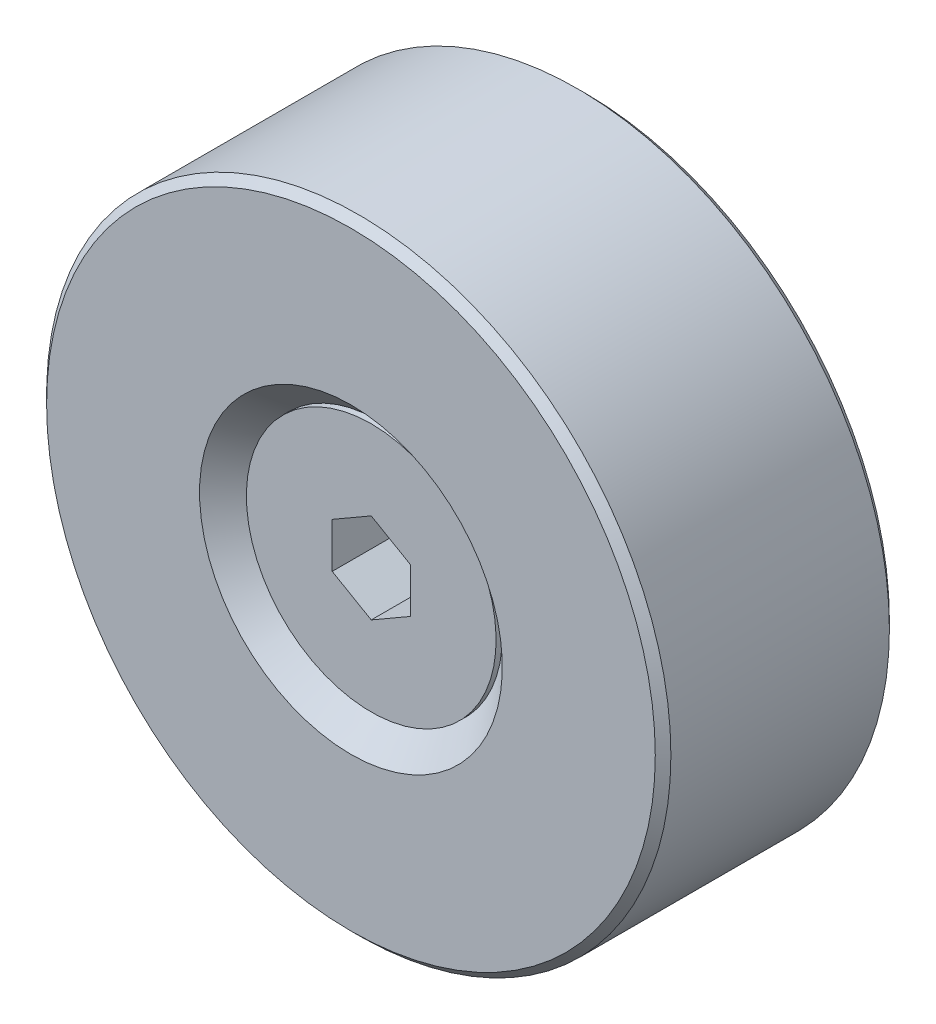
ISO-10303-21;
HEADER;
FILE_DESCRIPTION(('STEP AP214'),'2;1');
FILE_NAME('part.step','',(''),(''),'','','');
FILE_SCHEMA(('AUTOMOTIVE_DESIGN { 1 0 10303 214 1 1 1 1 }'));
ENDSEC;
DATA;
#1=APPLICATION_CONTEXT('core data for automotive mechanical design processes');
#2=APPLICATION_PROTOCOL_DEFINITION('international standard','automotive_design',2000,#1);
#3=PRODUCT_CONTEXT('',#1,'mechanical');
#4=PRODUCT('Part','Part','',(#3));
#5=PRODUCT_RELATED_PRODUCT_CATEGORY('part','',(#4));
#6=PRODUCT_DEFINITION_FORMATION('','',#4);
#7=PRODUCT_DEFINITION_CONTEXT('part definition',#1,'design');
#8=PRODUCT_DEFINITION('design','',#6,#7);
#9=PRODUCT_DEFINITION_SHAPE('','',#8);
#10=(LENGTH_UNIT() NAMED_UNIT(*) SI_UNIT(.MILLI.,.METRE.));
#11=(NAMED_UNIT(*) PLANE_ANGLE_UNIT() SI_UNIT($,.RADIAN.));
#12=(NAMED_UNIT(*) SI_UNIT($,.STERADIAN.) SOLID_ANGLE_UNIT());
#13=UNCERTAINTY_MEASURE_WITH_UNIT(LENGTH_MEASURE(1.E-05),#10,'distance_accuracy_value','');
#14=(GEOMETRIC_REPRESENTATION_CONTEXT(3) GLOBAL_UNCERTAINTY_ASSIGNED_CONTEXT((#13)) GLOBAL_UNIT_ASSIGNED_CONTEXT((#10,
#11,#12)) REPRESENTATION_CONTEXT('',''));
#15=CARTESIAN_POINT('',(0.,0.,0.));
#16=DIRECTION('',(0.,0.,1.));
#17=DIRECTION('',(1.,0.,0.));
#18=AXIS2_PLACEMENT_3D('',#15,#16,#17);
#19=CARTESIAN_POINT('',(0.,4.74999999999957,0.));
#20=DIRECTION('',(0.,0.,1.));
#21=DIRECTION('',(0.,-1.,0.));
#22=AXIS2_PLACEMENT_3D('',#19,#20,#21);
#23=PLANE('',#22);
#24=CARTESIAN_POINT('',(0.,0.,0.));
#25=DIRECTION('',(0.,0.,-1.));
#26=DIRECTION('',(0.,1.,0.));
#27=AXIS2_PLACEMENT_3D('',#24,#25,#26);
#28=CIRCLE('',#27,4.74999999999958);
#29=CARTESIAN_POINT('',(0.,4.74999999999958,0.));
#30=VERTEX_POINT('',#29);
#31=EDGE_CURVE('E116',#30,#30,#28,.T.);
#32=ORIENTED_EDGE('',*,*,#31,.F.);
#33=EDGE_LOOP('',(#32));
#34=FACE_BOUND('',#33,.T.);
#35=CARTESIAN_POINT('',(0.,0.,0.));
#36=DIRECTION('',(0.,0.,1.));
#37=DIRECTION('',(1.,0.,0.));
#38=AXIS2_PLACEMENT_3D('',#35,#36,#37);
#39=CIRCLE('',#38,19.5000000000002);
#40=CARTESIAN_POINT('',(19.5000000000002,0.,0.));
#41=VERTEX_POINT('',#40);
#42=EDGE_CURVE('E178',#41,#41,#39,.T.);
#43=ORIENTED_EDGE('',*,*,#42,.F.);
#44=EDGE_LOOP('',(#43));
#45=FACE_BOUND('',#44,.T.);
#46=ADVANCED_FACE('F14',(#34,#45),#23,.F.);
#47=CARTESIAN_POINT('',(0.,2.80000000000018,-11.3000000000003));
#48=DIRECTION('',(0.,0.,1.));
#49=DIRECTION('',(0.,-1.,0.));
#50=AXIS2_PLACEMENT_3D('',#47,#48,#49);
#51=PLANE('',#50);
#52=CARTESIAN_POINT('',(0.,1.16338863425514E-13,-11.3000000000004));
#53=DIRECTION('',(0.,0.,-1.));
#54=DIRECTION('',(0.,1.,0.));
#55=AXIS2_PLACEMENT_3D('',#52,#53,#54);
#56=CIRCLE('',#55,2.80000000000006);
#57=CARTESIAN_POINT('',(0.,2.80000000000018,-11.3000000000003));
#58=VERTEX_POINT('',#57);
#59=EDGE_CURVE('E136',#58,#58,#56,.T.);
#60=ORIENTED_EDGE('',*,*,#59,.T.);
#61=EDGE_LOOP('',(#60));
#62=FACE_BOUND('',#61,.T.);
#63=ADVANCED_FACE('F167',(#62),#51,.F.);
#64=CARTESIAN_POINT('',(0.,1.03672938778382E-13,-10.1000000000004));
#65=DIRECTION('',(0.,0.,1.));
#66=DIRECTION('',(0.,-1.,0.));
#67=AXIS2_PLACEMENT_3D('',#64,#65,#66);
#68=CONICAL_SURFACE('',#67,4.00000000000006,0.785398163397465);
#69=ORIENTED_EDGE('',*,*,#59,.F.);
#70=EDGE_LOOP('',(#69));
#71=FACE_BOUND('',#70,.T.);
#72=CARTESIAN_POINT('',(0.,1.03672938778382E-13,-10.1000000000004));
#73=DIRECTION('',(0.,0.,-1.));
#74=DIRECTION('',(0.,1.,0.));
#75=AXIS2_PLACEMENT_3D('',#72,#73,#74);
#76=CIRCLE('',#75,4.00000000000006);
#77=CARTESIAN_POINT('',(0.,4.00000000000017,-10.1000000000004));
#78=VERTEX_POINT('',#77);
#79=EDGE_CURVE('E133',#78,#78,#76,.T.);
#80=ORIENTED_EDGE('',*,*,#79,.T.);
#81=EDGE_LOOP('',(#80));
#82=FACE_BOUND('',#81,.T.);
#83=ADVANCED_FACE('F172',(#71,#82),#68,.T.);
#84=CARTESIAN_POINT('',(0.,2.08166817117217E-13,-20.));
#85=DIRECTION('',(0.,0.,-1.));
#86=DIRECTION('',(0.,1.,0.));
#87=AXIS2_PLACEMENT_3D('',#84,#85,#86);
#88=CYLINDRICAL_SURFACE('',#87,4.0000000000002);
#89=ORIENTED_EDGE('',*,*,#79,.F.);
#90=EDGE_LOOP('',(#89));
#91=FACE_BOUND('',#90,.T.);
#92=CARTESIAN_POINT('',(0.,-1.01092843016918E-13,9.29999999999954));
#93=DIRECTION('',(0.,0.,-1.));
#94=DIRECTION('',(0.,1.,0.));
#95=AXIS2_PLACEMENT_3D('',#92,#93,#94);
#96=CIRCLE('',#95,4.00000000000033);
#97=CARTESIAN_POINT('',(0.,4.00000000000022,9.29999999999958));
#98=VERTEX_POINT('',#97);
#99=EDGE_CURVE('E130',#98,#98,#96,.T.);
#100=ORIENTED_EDGE('',*,*,#99,.T.);
#101=EDGE_LOOP('',(#100));
#102=FACE_BOUND('',#101,.T.);
#103=ADVANCED_FACE('F222',(#91,#102),#88,.T.);
#104=CARTESIAN_POINT('',(0.,-1.03731577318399E-13,9.54999999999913));
#105=DIRECTION('',(0.,0.,1.));
#106=DIRECTION('',(0.,-1.,0.));
#107=AXIS2_PLACEMENT_3D('',#104,#105,#106);
#108=CONICAL_SURFACE('',#107,4.24999999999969,0.785398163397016);
#109=ORIENTED_EDGE('',*,*,#99,.F.);
#110=EDGE_LOOP('',(#109));
#111=FACE_BOUND('',#110,.T.);
#112=CARTESIAN_POINT('',(0.,-1.03731577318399E-13,9.54999999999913));
#113=DIRECTION('',(0.,0.,-1.));
#114=DIRECTION('',(0.,1.,0.));
#115=AXIS2_PLACEMENT_3D('',#112,#113,#114);
#116=CIRCLE('',#115,4.24999999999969);
#117=CARTESIAN_POINT('',(0.,4.24999999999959,9.54999999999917));
#118=VERTEX_POINT('',#117);
#119=EDGE_CURVE('E127',#118,#118,#116,.T.);
#120=ORIENTED_EDGE('',*,*,#119,.T.);
#121=EDGE_LOOP('',(#120));
#122=FACE_BOUND('',#121,.T.);
#123=ADVANCED_FACE('F218',(#111,#122),#108,.T.);
#124=CARTESIAN_POINT('',(0.,2.08166817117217E-13,-20.));
#125=DIRECTION('',(0.,0.,-1.));
#126=DIRECTION('',(0.,1.,0.));
#127=AXIS2_PLACEMENT_3D('',#124,#125,#126);
#128=CYLINDRICAL_SURFACE('',#127,4.24999999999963);
#129=ORIENTED_EDGE('',*,*,#119,.F.);
#130=EDGE_LOOP('',(#129));
#131=FACE_BOUND('',#130,.T.);
#132=CARTESIAN_POINT('',(0.,0.,0.499999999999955));
#133=DIRECTION('',(0.,0.,-1.));
#134=DIRECTION('',(0.,1.,0.));
#135=AXIS2_PLACEMENT_3D('',#132,#133,#134);
#136=CIRCLE('',#135,4.24999999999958);
#137=CARTESIAN_POINT('',(0.,4.24999999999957,0.5));
#138=VERTEX_POINT('',#137);
#139=EDGE_CURVE('E124',#138,#138,#136,.T.);
#140=ORIENTED_EDGE('',*,*,#139,.T.);
#141=EDGE_LOOP('',(#140));
#142=FACE_BOUND('',#141,.T.);
#143=ADVANCED_FACE('F214',(#131,#142),#128,.F.);
#144=CARTESIAN_POINT('',(0.,0.,0.));
#145=DIRECTION('',(0.,0.,-1.));
#146=DIRECTION('',(0.,1.,0.));
#147=AXIS2_PLACEMENT_3D('',#144,#145,#146);
#148=CONICAL_SURFACE('',#147,4.74999999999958,0.785398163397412);
#149=ORIENTED_EDGE('',*,*,#139,.F.);
#150=EDGE_LOOP('',(#149));
#151=FACE_BOUND('',#150,.T.);
#152=ORIENTED_EDGE('',*,*,#31,.T.);
#153=EDGE_LOOP('',(#152));
#154=FACE_BOUND('',#153,.T.);
#155=ADVANCED_FACE('F210',(#151,#154),#148,.F.);
#156=CARTESIAN_POINT('',(0.,0.,14.5));
#157=DIRECTION('',(0.,0.,-1.));
#158=DIRECTION('',(-1.,0.,0.));
#159=AXIS2_PLACEMENT_3D('',#156,#157,#158);
#160=CONICAL_SURFACE('',#159,20.0000000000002,0.785398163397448);
#161=CARTESIAN_POINT('',(0.,0.,15.));
#162=DIRECTION('',(0.,0.,1.));
#163=DIRECTION('',(1.,0.,0.));
#164=AXIS2_PLACEMENT_3D('',#161,#162,#163);
#165=CIRCLE('',#164,19.5000000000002);
#166=CARTESIAN_POINT('',(19.5000000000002,0.,15.));
#167=VERTEX_POINT('',#166);
#168=EDGE_CURVE('E103',#167,#167,#165,.T.);
#169=ORIENTED_EDGE('',*,*,#168,.F.);
#170=EDGE_LOOP('',(#169));
#171=FACE_BOUND('',#170,.T.);
#172=CARTESIAN_POINT('',(0.,0.,14.5));
#173=DIRECTION('',(0.,0.,1.));
#174=DIRECTION('',(1.,0.,0.));
#175=AXIS2_PLACEMENT_3D('',#172,#173,#174);
#176=CIRCLE('',#175,20.0000000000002);
#177=CARTESIAN_POINT('',(20.0000000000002,0.,14.5));
#178=VERTEX_POINT('',#177);
#179=EDGE_CURVE('E183',#178,#178,#176,.T.);
#180=ORIENTED_EDGE('',*,*,#179,.T.);
#181=EDGE_LOOP('',(#180));
#182=FACE_BOUND('',#181,.T.);
#183=ADVANCED_FACE('F213',(#171,#182),#160,.T.);
#184=CARTESIAN_POINT('',(0.,0.,22.9264003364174));
#185=DIRECTION('',(0.,0.,1.));
#186=DIRECTION('',(1.,0.,0.));
#187=AXIS2_PLACEMENT_3D('',#184,#185,#186);
#188=CYLINDRICAL_SURFACE('',#187,20.0000000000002);
#189=ORIENTED_EDGE('',*,*,#179,.F.);
#190=EDGE_LOOP('',(#189));
#191=FACE_BOUND('',#190,.T.);
#192=CARTESIAN_POINT('',(0.,0.,0.499999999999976));
#193=DIRECTION('',(0.,0.,1.));
#194=DIRECTION('',(1.,0.,0.));
#195=AXIS2_PLACEMENT_3D('',#192,#193,#194);
#196=CIRCLE('',#195,20.0000000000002);
#197=CARTESIAN_POINT('',(20.0000000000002,0.,0.499999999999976));
#198=VERTEX_POINT('',#197);
#199=EDGE_CURVE('E180',#198,#198,#196,.T.);
#200=ORIENTED_EDGE('',*,*,#199,.T.);
#201=EDGE_LOOP('',(#200));
#202=FACE_BOUND('',#201,.T.);
#203=ADVANCED_FACE('F272',(#191,#202),#188,.T.);
#204=CARTESIAN_POINT('',(0.,0.,0.));
#205=DIRECTION('',(0.,0.,1.));
#206=DIRECTION('',(1.,0.,0.));
#207=AXIS2_PLACEMENT_3D('',#204,#205,#206);
#208=CONICAL_SURFACE('',#207,19.5000000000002,0.785398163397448);
#209=ORIENTED_EDGE('',*,*,#199,.F.);
#210=EDGE_LOOP('',(#209));
#211=FACE_BOUND('',#210,.T.);
#212=ORIENTED_EDGE('',*,*,#42,.T.);
#213=EDGE_LOOP('',(#212));
#214=FACE_BOUND('',#213,.T.);
#215=ADVANCED_FACE('F280',(#211,#214),#208,.T.);
#216=CARTESIAN_POINT('',(0.,2.88675134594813,9.69999999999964));
#217=DIRECTION('',(0.,0.,1.));
#218=DIRECTION('',(1.,0.,0.));
#219=AXIS2_PLACEMENT_3D('',#216,#217,#218);
#220=PLANE('',#219);
#221=DIRECTION('',(-0.866025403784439,0.5,0.));
#222=VECTOR('',#221,1.);
#223=CARTESIAN_POINT('',(2.5,1.44337567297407,9.69999999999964));
#224=LINE('',#223,#222);
#225=CARTESIAN_POINT('',(2.5,1.44337567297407,9.69999999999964));
#226=VERTEX_POINT('',#225);
#227=CARTESIAN_POINT('',(0.,2.88675134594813,9.69999999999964));
#228=VERTEX_POINT('',#227);
#229=EDGE_CURVE('E114',#226,#228,#224,.T.);
#230=ORIENTED_EDGE('',*,*,#229,.T.);
#231=DIRECTION('',(-0.866025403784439,-0.5,0.));
#232=VECTOR('',#231,1.);
#233=CARTESIAN_POINT('',(0.,2.88675134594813,9.69999999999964));
#234=LINE('',#233,#232);
#235=CARTESIAN_POINT('',(-2.5,1.44337567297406,9.69999999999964));
#236=VERTEX_POINT('',#235);
#237=EDGE_CURVE('E96',#228,#236,#234,.T.);
#238=ORIENTED_EDGE('',*,*,#237,.T.);
#239=DIRECTION('',(0.,-1.,0.));
#240=VECTOR('',#239,1.);
#241=CARTESIAN_POINT('',(-2.5,1.44337567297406,9.69999999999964));
#242=LINE('',#241,#240);
#243=CARTESIAN_POINT('',(-2.5,-1.44337567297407,9.69999999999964));
#244=VERTEX_POINT('',#243);
#245=EDGE_CURVE('E94',#236,#244,#242,.T.);
#246=ORIENTED_EDGE('',*,*,#245,.T.);
#247=DIRECTION('',(0.866025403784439,-0.5,0.));
#248=VECTOR('',#247,1.);
#249=CARTESIAN_POINT('',(-2.5,-1.44337567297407,9.69999999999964));
#250=LINE('',#249,#248);
#251=CARTESIAN_POINT('',(0.,-2.88675134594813,9.69999999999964));
#252=VERTEX_POINT('',#251);
#253=EDGE_CURVE('E73',#244,#252,#250,.T.);
#254=ORIENTED_EDGE('',*,*,#253,.T.);
#255=DIRECTION('',(0.866025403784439,0.5,0.));
#256=VECTOR('',#255,1.);
#257=CARTESIAN_POINT('',(0.,-2.88675134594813,9.69999999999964));
#258=LINE('',#257,#256);
#259=CARTESIAN_POINT('',(2.5,-1.44337567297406,9.69999999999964));
#260=VERTEX_POINT('',#259);
#261=EDGE_CURVE('E84',#252,#260,#258,.T.);
#262=ORIENTED_EDGE('',*,*,#261,.T.);
#263=DIRECTION('',(0.,1.,0.));
#264=VECTOR('',#263,1.);
#265=CARTESIAN_POINT('',(2.5,-1.44337567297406,9.69999999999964));
#266=LINE('',#265,#264);
#267=EDGE_CURVE('E88',#260,#226,#266,.T.);
#268=ORIENTED_EDGE('',*,*,#267,.T.);
#269=EDGE_LOOP('',(#230,#238,#246,#254,#262,#268));
#270=FACE_BOUND('',#269,.T.);
#271=ADVANCED_FACE('F91',(#270),#220,.T.);
#272=CARTESIAN_POINT('',(-2.5,1.44337567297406,9.69999999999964));
#273=DIRECTION('',(-1.,0.,0.));
#274=DIRECTION('',(0.,-1.,0.));
#275=AXIS2_PLACEMENT_3D('',#272,#273,#274);
#276=PLANE('',#275);
#277=DIRECTION('',(0.,-1.,0.));
#278=VECTOR('',#277,1.);
#279=CARTESIAN_POINT('',(-2.5,1.44337567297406,13.6999999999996));
#280=LINE('',#279,#278);
#281=CARTESIAN_POINT('',(-2.5,1.44337567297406,13.6999999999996));
#282=VERTEX_POINT('',#281);
#283=CARTESIAN_POINT('',(-2.5,-1.44337567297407,13.6999999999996));
#284=VERTEX_POINT('',#283);
#285=EDGE_CURVE('E106',#282,#284,#280,.T.);
#286=ORIENTED_EDGE('',*,*,#285,.T.);
#287=DIRECTION('',(0.,0.,1.));
#288=VECTOR('',#287,1.);
#289=CARTESIAN_POINT('',(-2.5,-1.44337567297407,9.69999999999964));
#290=LINE('',#289,#288);
#291=EDGE_CURVE('E81',#244,#284,#290,.T.);
#292=ORIENTED_EDGE('',*,*,#291,.F.);
#293=ORIENTED_EDGE('',*,*,#245,.F.);
#294=DIRECTION('',(0.,0.,1.));
#295=VECTOR('',#294,1.);
#296=CARTESIAN_POINT('',(-2.5,1.44337567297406,9.69999999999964));
#297=LINE('',#296,#295);
#298=EDGE_CURVE('E119',#236,#282,#297,.T.);
#299=ORIENTED_EDGE('',*,*,#298,.T.);
#300=EDGE_LOOP('',(#286,#292,#293,#299));
#301=FACE_BOUND('',#300,.T.);
#302=ADVANCED_FACE('F192',(#301),#276,.F.);
#303=CARTESIAN_POINT('',(-2.5,-1.44337567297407,9.69999999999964));
#304=DIRECTION('',(-0.5,-0.866025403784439,0.));
#305=DIRECTION('',(0.866025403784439,-0.5,0.));
#306=AXIS2_PLACEMENT_3D('',#303,#304,#305);
#307=PLANE('',#306);
#308=DIRECTION('',(0.866025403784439,-0.5,0.));
#309=VECTOR('',#308,1.);
#310=CARTESIAN_POINT('',(-2.5,-1.44337567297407,13.6999999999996));
#311=LINE('',#310,#309);
#312=CARTESIAN_POINT('',(0.,-2.88675134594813,13.6999999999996));
#313=VERTEX_POINT('',#312);
#314=EDGE_CURVE('E76',#284,#313,#311,.T.);
#315=ORIENTED_EDGE('',*,*,#314,.T.);
#316=DIRECTION('',(0.,0.,1.));
#317=VECTOR('',#316,1.);
#318=CARTESIAN_POINT('',(0.,-2.88675134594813,9.69999999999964));
#319=LINE('',#318,#317);
#320=EDGE_CURVE('E69',#252,#313,#319,.T.);
#321=ORIENTED_EDGE('',*,*,#320,.F.);
#322=ORIENTED_EDGE('',*,*,#253,.F.);
#323=ORIENTED_EDGE('',*,*,#291,.T.);
#324=EDGE_LOOP('',(#315,#321,#322,#323));
#325=FACE_BOUND('',#324,.T.);
#326=ADVANCED_FACE('F71',(#325),#307,.F.);
#327=CARTESIAN_POINT('',(0.,-2.88675134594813,9.69999999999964));
#328=DIRECTION('',(0.5,-0.866025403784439,0.));
#329=DIRECTION('',(0.866025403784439,0.5,0.));
#330=AXIS2_PLACEMENT_3D('',#327,#328,#329);
#331=PLANE('',#330);
#332=DIRECTION('',(0.866025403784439,0.5,0.));
#333=VECTOR('',#332,1.);
#334=CARTESIAN_POINT('',(0.,-2.88675134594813,13.6999999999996));
#335=LINE('',#334,#333);
#336=CARTESIAN_POINT('',(2.5,-1.44337567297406,13.6999999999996));
#337=VERTEX_POINT('',#336);
#338=EDGE_CURVE('E110',#313,#337,#335,.T.);
#339=ORIENTED_EDGE('',*,*,#338,.T.);
#340=DIRECTION('',(0.,0.,1.));
#341=VECTOR('',#340,1.);
#342=CARTESIAN_POINT('',(2.5,-1.44337567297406,9.69999999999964));
#343=LINE('',#342,#341);
#344=EDGE_CURVE('E80',#260,#337,#343,.T.);
#345=ORIENTED_EDGE('',*,*,#344,.F.);
#346=ORIENTED_EDGE('',*,*,#261,.F.);
#347=ORIENTED_EDGE('',*,*,#320,.T.);
#348=EDGE_LOOP('',(#339,#345,#346,#347));
#349=FACE_BOUND('',#348,.T.);
#350=ADVANCED_FACE('F85',(#349),#331,.F.);
#351=CARTESIAN_POINT('',(2.5,-1.44337567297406,9.69999999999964));
#352=DIRECTION('',(1.,0.,0.));
#353=DIRECTION('',(0.,0.,-1.));
#354=AXIS2_PLACEMENT_3D('',#351,#352,#353);
#355=PLANE('',#354);
#356=DIRECTION('',(0.,1.,0.));
#357=VECTOR('',#356,1.);
#358=CARTESIAN_POINT('',(2.5,-1.44337567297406,13.6999999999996));
#359=LINE('',#358,#357);
#360=CARTESIAN_POINT('',(2.5,1.44337567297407,13.6999999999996));
#361=VERTEX_POINT('',#360);
#362=EDGE_CURVE('E112',#337,#361,#359,.T.);
#363=ORIENTED_EDGE('',*,*,#362,.T.);
#364=DIRECTION('',(0.,0.,1.));
#365=VECTOR('',#364,1.);
#366=CARTESIAN_POINT('',(2.5,1.44337567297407,9.69999999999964));
#367=LINE('',#366,#365);
#368=EDGE_CURVE('E36',#226,#361,#367,.T.);
#369=ORIENTED_EDGE('',*,*,#368,.F.);
#370=ORIENTED_EDGE('',*,*,#267,.F.);
#371=ORIENTED_EDGE('',*,*,#344,.T.);
#372=EDGE_LOOP('',(#363,#369,#370,#371));
#373=FACE_BOUND('',#372,.T.);
#374=ADVANCED_FACE('F194',(#373),#355,.F.);
#375=CARTESIAN_POINT('',(2.5,1.44337567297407,9.69999999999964));
#376=DIRECTION('',(0.5,0.866025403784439,0.));
#377=DIRECTION('',(-0.866025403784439,0.5,0.));
#378=AXIS2_PLACEMENT_3D('',#375,#376,#377);
#379=PLANE('',#378);
#380=DIRECTION('',(-0.866025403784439,0.5,0.));
#381=VECTOR('',#380,1.);
#382=CARTESIAN_POINT('',(2.5,1.44337567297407,13.6999999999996));
#383=LINE('',#382,#381);
#384=CARTESIAN_POINT('',(0.,2.88675134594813,13.6999999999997));
#385=VERTEX_POINT('',#384);
#386=EDGE_CURVE('E28',#361,#385,#383,.T.);
#387=ORIENTED_EDGE('',*,*,#386,.T.);
#388=DIRECTION('',(0.,0.,1.));
#389=VECTOR('',#388,1.);
#390=CARTESIAN_POINT('',(0.,2.88675134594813,9.69999999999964));
#391=LINE('',#390,#389);
#392=EDGE_CURVE('E58',#228,#385,#391,.T.);
#393=ORIENTED_EDGE('',*,*,#392,.F.);
#394=ORIENTED_EDGE('',*,*,#229,.F.);
#395=ORIENTED_EDGE('',*,*,#368,.T.);
#396=EDGE_LOOP('',(#387,#393,#394,#395));
#397=FACE_BOUND('',#396,.T.);
#398=ADVANCED_FACE('F161',(#397),#379,.F.);
#399=CARTESIAN_POINT('',(0.,2.88675134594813,9.69999999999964));
#400=DIRECTION('',(-0.5,0.866025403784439,0.));
#401=DIRECTION('',(-0.866025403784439,-0.5,0.));
#402=AXIS2_PLACEMENT_3D('',#399,#400,#401);
#403=PLANE('',#402);
#404=DIRECTION('',(-0.866025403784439,-0.5,0.));
#405=VECTOR('',#404,1.);
#406=CARTESIAN_POINT('',(0.,2.88675134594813,13.6999999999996));
#407=LINE('',#406,#405);
#408=EDGE_CURVE('E102',#385,#282,#407,.T.);
#409=ORIENTED_EDGE('',*,*,#408,.T.);
#410=ORIENTED_EDGE('',*,*,#298,.F.);
#411=ORIENTED_EDGE('',*,*,#237,.F.);
#412=ORIENTED_EDGE('',*,*,#392,.T.);
#413=EDGE_LOOP('',(#409,#410,#411,#412));
#414=FACE_BOUND('',#413,.T.);
#415=ADVANCED_FACE('F154',(#414),#403,.F.);
#416=CARTESIAN_POINT('',(0.,1.38777878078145E-13,13.6999999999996));
#417=DIRECTION('',(0.,0.,-1.));
#418=DIRECTION('',(0.,1.,0.));
#419=AXIS2_PLACEMENT_3D('',#416,#417,#418);
#420=PLANE('',#419);
#421=ORIENTED_EDGE('',*,*,#408,.F.);
#422=ORIENTED_EDGE('',*,*,#386,.F.);
#423=ORIENTED_EDGE('',*,*,#362,.F.);
#424=ORIENTED_EDGE('',*,*,#338,.F.);
#425=ORIENTED_EDGE('',*,*,#314,.F.);
#426=ORIENTED_EDGE('',*,*,#285,.F.);
#427=EDGE_LOOP('',(#421,#422,#423,#424,#425,#426));
#428=FACE_BOUND('',#427,.T.);
#429=CARTESIAN_POINT('',(0.,-1.47534566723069E-13,13.6999999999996));
#430=DIRECTION('',(0.,0.,-1.));
#431=DIRECTION('',(0.,1.,0.));
#432=AXIS2_PLACEMENT_3D('',#429,#430,#431);
#433=CIRCLE('',#432,8.00000000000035);
#434=CARTESIAN_POINT('',(0.,8.0000000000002,13.6999999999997));
#435=VERTEX_POINT('',#434);
#436=EDGE_CURVE('E139',#435,#435,#433,.T.);
#437=ORIENTED_EDGE('',*,*,#436,.F.);
#438=EDGE_LOOP('',(#437));
#439=FACE_BOUND('',#438,.T.);
#440=ADVANCED_FACE('F149',(#428,#439),#420,.F.);
#441=CARTESIAN_POINT('',(0.,2.08166817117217E-13,-20.));
#442=DIRECTION('',(0.,0.,-1.));
#443=DIRECTION('',(0.,1.,0.));
#444=AXIS2_PLACEMENT_3D('',#441,#442,#443);
#445=CYLINDRICAL_SURFACE('',#444,8.00000000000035);
#446=CARTESIAN_POINT('',(0.,-1.43312591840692E-13,13.2999999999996));
#447=DIRECTION('',(0.,0.,-1.));
#448=DIRECTION('',(0.,1.,0.));
#449=AXIS2_PLACEMENT_3D('',#446,#447,#448);
#450=CIRCLE('',#449,8.00000000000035);
#451=CARTESIAN_POINT('',(0.,8.00000000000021,13.2999999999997));
#452=VERTEX_POINT('',#451);
#453=EDGE_CURVE('E21',#452,#452,#450,.T.);
#454=ORIENTED_EDGE('',*,*,#453,.F.);
#455=EDGE_LOOP('',(#454));
#456=FACE_BOUND('',#455,.T.);
#457=ORIENTED_EDGE('',*,*,#436,.T.);
#458=EDGE_LOOP('',(#457));
#459=FACE_BOUND('',#458,.T.);
#460=ADVANCED_FACE('F146',(#456,#459),#445,.T.);
#461=CARTESIAN_POINT('',(0.,-1.43312591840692E-13,13.2999999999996));
#462=DIRECTION('',(0.,0.,1.));
#463=DIRECTION('',(0.,-1.,0.));
#464=AXIS2_PLACEMENT_3D('',#461,#462,#463);
#465=CONICAL_SURFACE('',#464,8.00000000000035,0.785398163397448);
#466=CARTESIAN_POINT('',(0.,-1.61255985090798E-13,14.9999999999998));
#467=DIRECTION('',(0.,0.,-1.));
#468=DIRECTION('',(0.,1.,0.));
#469=AXIS2_PLACEMENT_3D('',#466,#467,#468);
#470=CIRCLE('',#469,9.70000000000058);
#471=CARTESIAN_POINT('',(0.,9.70000000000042,14.9999999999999));
#472=VERTEX_POINT('',#471);
#473=EDGE_CURVE('E9',#472,#472,#470,.T.);
#474=ORIENTED_EDGE('',*,*,#473,.F.);
#475=EDGE_LOOP('',(#474));
#476=FACE_BOUND('',#475,.T.);
#477=ORIENTED_EDGE('',*,*,#453,.T.);
#478=EDGE_LOOP('',(#477));
#479=FACE_BOUND('',#478,.T.);
#480=ADVANCED_FACE('F144',(#476,#479),#465,.F.);
#481=CARTESIAN_POINT('',(0.,14.5000000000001,15.));
#482=DIRECTION('',(0.,0.,-1.));
#483=DIRECTION('',(0.,1.,0.));
#484=AXIS2_PLACEMENT_3D('',#481,#482,#483);
#485=PLANE('',#484);
#486=ORIENTED_EDGE('',*,*,#473,.T.);
#487=EDGE_LOOP('',(#486));
#488=FACE_BOUND('',#487,.T.);
#489=ORIENTED_EDGE('',*,*,#168,.T.);
#490=EDGE_LOOP('',(#489));
#491=FACE_BOUND('',#490,.T.);
#492=ADVANCED_FACE('F352',(#488,#491),#485,.F.);
#493=CLOSED_SHELL('',(#46,#63,#83,#103,#123,#143,#155,#183,#203,#215,#271,#302,#326,#350,#374,
#398,#415,#440,#460,#480,#492));
#494=MANIFOLD_SOLID_BREP('B1',#493);
#495=ADVANCED_BREP_SHAPE_REPRESENTATION('',(#18,#494),#14);
#496=SHAPE_DEFINITION_REPRESENTATION(#9,#495);
ENDSEC;
END-ISO-10303-21;
